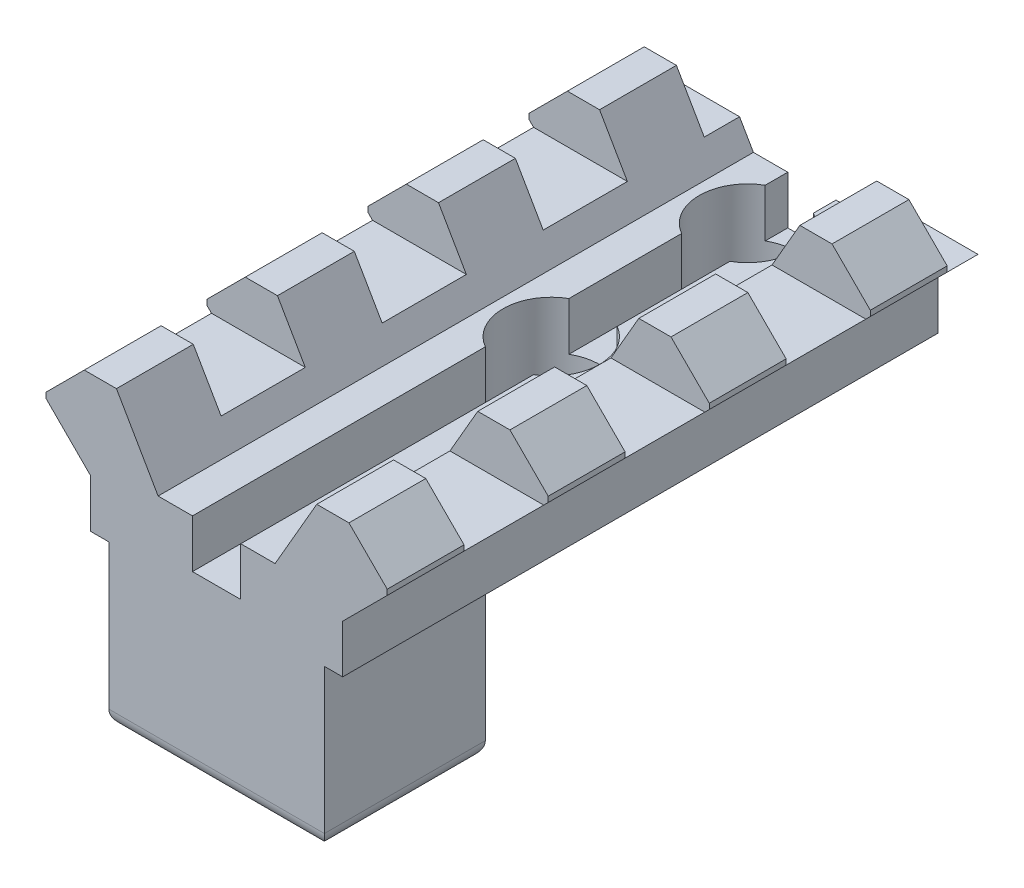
from build123d import *

# Parameters (mm, degrees)
SKETCH1_R           = 1.500250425
BOSS_EXTRUDE1_DEPTH = 5
SKETCH2_R           = 3
CUT_EXTRUDE1_DEPTH  = 3
SKETCH3_W           = 13.4
SKETCH3_H           = 10
BOSS_EXTRUDE2_DEPTH = 5
BOSS_EXTRUDE3_DEPTH = 37
SKETCH5_W           = 5.2324
SKETCH5_H           = 2.9972
CUT_EXTRUDE2_DEPTH  = 37.955681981
SKETCH6_R           = 3
CUT_EXTRUDE3_DEPTH  = 8.4864
CUT_EXTRUDE4_DEPTH  = 41.784045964
FILLET1_R           = 1
SKETCH8_W           = 27
SKETCH8_H           = 1
CUT_EXTRUDE6_DEPTH  = 34.389184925


with BuildPart() as part:
    # Sketch1 → Boss-Extrude1 (new body)
    with BuildSketch(Plane(origin=(0, 0, 0), x_dir=(1, 0, 0), z_dir=(0, 1, 0))):
        Polygon((-3.5, 27.09276222), (3.5, 27.09276222), (3.5, 0.09276222), (6.7, 0.09276222), (6.7, -9.90723778), (-6.7, -9.90723778), (-6.7, 0.09276222), (-3.5, 0.09276222), align=None)
        with Locations(Location((0, 23.09276222, 0), (0, 0, 270))):
            Circle(SKETCH1_R, mode=Mode.SUBTRACT)
        with Locations(Location((0, 10.89326307, 0), (0, 0, 270))):
            Circle(SKETCH1_R, mode=Mode.SUBTRACT)
    extrude(amount=BOSS_EXTRUDE1_DEPTH)

    # Sketch2 → Cut-Extrude1 (cut)
    with BuildSketch(Plane(origin=(0, 5, 0), x_dir=(1, 0, 0), z_dir=(0, 1, 0))):
        with Locations(Location((0, 10.89326307, 0), (0, 0, 270))):
            Circle(SKETCH2_R)
        with Locations(Location((0, 23.09276222, 0), (0, 0, 270))):
            Circle(SKETCH2_R)
    extrude(amount=-CUT_EXTRUDE1_DEPTH, mode=Mode.SUBTRACT)

    # Sketch3 → Boss-Extrude2 (add)
    with BuildSketch(Plane.XZ):
        with Locations((0, 4.90723778)):
            Rectangle(SKETCH3_W, SKETCH3_H)
    extrude(amount=BOSS_EXTRUDE2_DEPTH)

    # Sketch4 → Boss-Extrude3 (add)
    with BuildSketch(Plane.XY.offset(9.90723778)):
        Polygon((-7.8359, 8), (-7.8359, 5), (-6.7, 5), (6.7, 5), (7.8359, 5), (7.8359, 8), (10.6045, 10.7686), (10.6045, 11.107266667), (8.225366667, 13.4864), (-8.225366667, 13.4864), (-10.6045, 11.107266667), (-10.6045, 10.7686), align=None)
    extrude(amount=-BOSS_EXTRUDE3_DEPTH)

    # Sketch5 → Cut-Extrude2 (cut, through all)
    with BuildSketch(Plane(origin=(10.6045, 0, 0), x_dir=(0, 0, -1), z_dir=(1, 0, 0))):
        with Locations((-2.51583778, 11.9878)):
            Rectangle(SKETCH5_W, SKETCH5_H)
        with Locations((7.49416222, 11.9878)):
            Rectangle(SKETCH5_W, SKETCH5_H)
        with Locations((17.50416222, 11.9878)):
            Rectangle(SKETCH5_W, SKETCH5_H)
        with Locations((27.51416222, 11.9878)):
            Rectangle(SKETCH5_W, SKETCH5_H)
    extrude(amount=-CUT_EXTRUDE2_DEPTH, mode=Mode.SUBTRACT)

    # Sketch6 → Cut-Extrude3 (cut)
    with BuildSketch(Plane(origin=(0, 13.4864, 0), x_dir=(1, 0, 0), z_dir=(0, 1, 0))):
        with Locations(Location((0, 23.09276222, 0), (0, 0, 270))):
            Circle(SKETCH6_R)
        with Locations(Location((0, 10.89326307, 0), (0, 0, 270))):
            Circle(SKETCH6_R)
    extrude(amount=-CUT_EXTRUDE3_DEPTH, mode=Mode.SUBTRACT)

    # Sketch7 → Cut-Extrude4 (cut, through all)
    with BuildSketch(Plane.XY.offset(9.90723778)):
        Polygon((-1.5, 6), (1.5, 6), (1.5, 9), (3.635142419, 9), (6.225366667, 13.4864), (-6.225366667, 13.4864), (-3.635142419, 9), (-1.5, 9), align=None)
    extrude(amount=-CUT_EXTRUDE4_DEPTH, mode=Mode.SUBTRACT)

    # Fillet1
    fillet1_edges = [part.edges().sort_by_distance(p)[0] for p in [
        (6.7, -5, 4.90723778),
        (0, -5, 9.90723778),
        (-6.7, -5, 4.90723778),
        (0, -5, -0.09276222),
    ]]
    fillet(fillet1_edges, radius=FILLET1_R)

    # Sketch8 → Cut-Extrude6 (cut, through all)
    with BuildSketch(Plane(origin=(3.5, 0, 0), x_dir=(0, 0, -1), z_dir=(1, 0, 0))):
        with Locations((13.59276222, 0.5)):
            Rectangle(SKETCH8_W, SKETCH8_H)
    extrude(amount=-CUT_EXTRUDE6_DEPTH, mode=Mode.SUBTRACT)


solid = part.part
